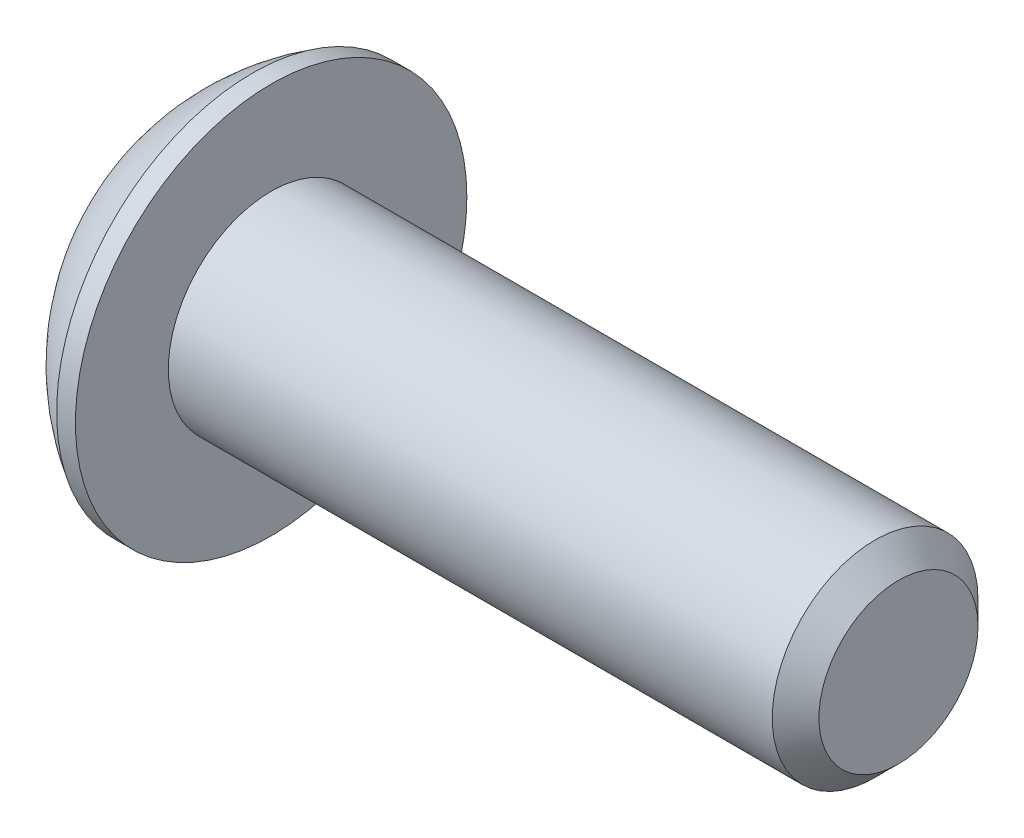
ISO-10303-21;
HEADER;
FILE_DESCRIPTION(('STEP AP214'),'2;1');
FILE_NAME('part.step','',(''),(''),'','','');
FILE_SCHEMA(('AUTOMOTIVE_DESIGN { 1 0 10303 214 1 1 1 1 }'));
ENDSEC;
DATA;
#1=APPLICATION_CONTEXT('core data for automotive mechanical design processes');
#2=APPLICATION_PROTOCOL_DEFINITION('international standard','automotive_design',2000,#1);
#3=PRODUCT_CONTEXT('',#1,'mechanical');
#4=PRODUCT('Part','Part','',(#3));
#5=PRODUCT_RELATED_PRODUCT_CATEGORY('part','',(#4));
#6=PRODUCT_DEFINITION_FORMATION('','',#4);
#7=PRODUCT_DEFINITION_CONTEXT('part definition',#1,'design');
#8=PRODUCT_DEFINITION('design','',#6,#7);
#9=PRODUCT_DEFINITION_SHAPE('','',#8);
#10=(LENGTH_UNIT() NAMED_UNIT(*) SI_UNIT(.MILLI.,.METRE.));
#11=(NAMED_UNIT(*) PLANE_ANGLE_UNIT() SI_UNIT($,.RADIAN.));
#12=(NAMED_UNIT(*) SI_UNIT($,.STERADIAN.) SOLID_ANGLE_UNIT());
#13=UNCERTAINTY_MEASURE_WITH_UNIT(LENGTH_MEASURE(1.E-05),#10,'distance_accuracy_value','');
#14=(GEOMETRIC_REPRESENTATION_CONTEXT(3) GLOBAL_UNCERTAINTY_ASSIGNED_CONTEXT((#13)) GLOBAL_UNIT_ASSIGNED_CONTEXT((#10,
#11,#12)) REPRESENTATION_CONTEXT('',''));
#15=CARTESIAN_POINT('',(0.,0.,0.));
#16=DIRECTION('',(0.,0.,1.));
#17=DIRECTION('',(1.,0.,0.));
#18=AXIS2_PLACEMENT_3D('',#15,#16,#17);
#19=CARTESIAN_POINT('',(7.4549,0.,0.));
#20=DIRECTION('',(1.,0.,0.));
#21=DIRECTION('',(0.,0.,-1.));
#22=AXIS2_PLACEMENT_3D('',#19,#20,#21);
#23=PLANE('',#22);
#24=CARTESIAN_POINT('',(7.4549,0.,0.));
#25=DIRECTION('',(1.,0.,0.));
#26=DIRECTION('',(0.,0.,-1.));
#27=AXIS2_PLACEMENT_3D('',#24,#25,#26);
#28=CIRCLE('',#27,1.6104);
#29=CARTESIAN_POINT('',(7.4549,0.,-1.6104));
#30=VERTEX_POINT('',#29);
#31=EDGE_CURVE('E40',#30,#30,#28,.T.);
#32=ORIENTED_EDGE('',*,*,#31,.T.);
#33=EDGE_LOOP('',(#32));
#34=FACE_BOUND('',#33,.T.);
#35=ADVANCED_FACE('F32',(#34),#23,.T.);
#36=CARTESIAN_POINT('',(7.4549,0.,0.));
#37=DIRECTION('',(1.,0.,0.));
#38=DIRECTION('',(0.,0.,-1.));
#39=AXIS2_PLACEMENT_3D('',#36,#37,#38);
#40=CYLINDRICAL_SURFACE('',#39,2.0828);
#41=CARTESIAN_POINT('',(6.9825,0.,0.));
#42=DIRECTION('',(1.,0.,0.));
#43=DIRECTION('',(0.,0.,-1.));
#44=AXIS2_PLACEMENT_3D('',#41,#42,#43);
#45=CIRCLE('',#44,2.0828);
#46=CARTESIAN_POINT('',(6.9825,0.,-2.0828));
#47=VERTEX_POINT('',#46);
#48=EDGE_CURVE('E11',#47,#47,#45,.F.);
#49=ORIENTED_EDGE('',*,*,#48,.T.);
#50=EDGE_LOOP('',(#49));
#51=FACE_BOUND('',#50,.T.);
#52=CARTESIAN_POINT('',(-5.2451,0.,0.));
#53=DIRECTION('',(1.,0.,0.));
#54=DIRECTION('',(0.,0.,-1.));
#55=AXIS2_PLACEMENT_3D('',#52,#53,#54);
#56=CIRCLE('',#55,2.0828);
#57=CARTESIAN_POINT('',(-5.2451,0.,-2.0828));
#58=VERTEX_POINT('',#57);
#59=EDGE_CURVE('E178',#58,#58,#56,.T.);
#60=ORIENTED_EDGE('',*,*,#59,.T.);
#61=EDGE_LOOP('',(#60));
#62=FACE_BOUND('',#61,.T.);
#63=ADVANCED_FACE('F305',(#51,#62),#40,.T.);
#64=CARTESIAN_POINT('',(-5.2451,2.0828,0.));
#65=DIRECTION('',(1.,0.,0.));
#66=DIRECTION('',(0.,0.,-1.));
#67=AXIS2_PLACEMENT_3D('',#64,#65,#66);
#68=PLANE('',#67);
#69=CARTESIAN_POINT('',(-5.2451,0.,0.));
#70=DIRECTION('',(1.,0.,0.));
#71=DIRECTION('',(0.,0.,-1.));
#72=AXIS2_PLACEMENT_3D('',#69,#70,#71);
#73=CIRCLE('',#72,3.9624);
#74=CARTESIAN_POINT('',(-5.2451,0.,-3.9624));
#75=VERTEX_POINT('',#74);
#76=EDGE_CURVE('E325',#75,#75,#73,.T.);
#77=ORIENTED_EDGE('',*,*,#76,.T.);
#78=EDGE_LOOP('',(#77));
#79=FACE_BOUND('',#78,.T.);
#80=ORIENTED_EDGE('',*,*,#59,.F.);
#81=EDGE_LOOP('',(#80));
#82=FACE_BOUND('',#81,.T.);
#83=ADVANCED_FACE('F301',(#79,#82),#68,.T.);
#84=CARTESIAN_POINT('',(7.4549,0.,0.));
#85=DIRECTION('',(1.,0.,0.));
#86=DIRECTION('',(0.,0.,-1.));
#87=AXIS2_PLACEMENT_3D('',#84,#85,#86);
#88=CYLINDRICAL_SURFACE('',#87,3.9624);
#89=CARTESIAN_POINT('',(-5.62610000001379,0.,0.));
#90=DIRECTION('',(1.,0.,0.));
#91=DIRECTION('',(0.,0.,-1.));
#92=AXIS2_PLACEMENT_3D('',#89,#90,#91);
#93=CIRCLE('',#92,3.9624);
#94=CARTESIAN_POINT('',(-5.62610000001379,0.,-3.9624));
#95=VERTEX_POINT('',#94);
#96=EDGE_CURVE('E327',#95,#95,#93,.T.);
#97=ORIENTED_EDGE('',*,*,#96,.T.);
#98=EDGE_LOOP('',(#97));
#99=FACE_BOUND('',#98,.T.);
#100=ORIENTED_EDGE('',*,*,#76,.F.);
#101=EDGE_LOOP('',(#100));
#102=FACE_BOUND('',#101,.T.);
#103=ADVANCED_FACE('F297',(#99,#102),#88,.T.);
#104=CARTESIAN_POINT('',(-3.3210413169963,0.,0.));
#105=DIRECTION('',(1.,0.,0.));
#106=DIRECTION('',(0.,0.,-1.));
#107=AXIS2_PLACEMENT_3D('',#104,#105,#106);
#108=DEGENERATE_TOROIDAL_SURFACE('',#107,8.01506428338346E-06,4.5841,.F.);
#109=CARTESIAN_POINT('',(-7.4549,0.,0.));
#110=DIRECTION('',(1.,0.,0.));
#111=DIRECTION('',(0.,0.,-1.));
#112=AXIS2_PLACEMENT_3D('',#109,#110,#111);
#113=CIRCLE('',#112,1.9812);
#114=CARTESIAN_POINT('',(-7.4549,0.,-1.9812));
#115=VERTEX_POINT('',#114);
#116=EDGE_CURVE('E330',#115,#115,#113,.T.);
#117=ORIENTED_EDGE('',*,*,#116,.T.);
#118=EDGE_LOOP('',(#117));
#119=FACE_BOUND('',#118,.T.);
#120=ORIENTED_EDGE('',*,*,#96,.F.);
#121=EDGE_LOOP('',(#120));
#122=FACE_BOUND('',#121,.T.);
#123=ADVANCED_FACE('F293',(#119,#122),#108,.F.);
#124=CARTESIAN_POINT('',(-7.4549,1.9812,0.));
#125=DIRECTION('',(-1.,0.,0.));
#126=DIRECTION('',(0.,0.,1.));
#127=AXIS2_PLACEMENT_3D('',#124,#125,#126);
#128=PLANE('',#127);
#129=CARTESIAN_POINT('',(-7.4549,0.,0.));
#130=DIRECTION('',(-1.,0.,0.));
#131=DIRECTION('',(0.,0.,1.));
#132=AXIS2_PLACEMENT_3D('',#129,#130,#131);
#133=CIRCLE('',#132,1.194);
#134=CARTESIAN_POINT('',(-7.4549,1.02293455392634,0.6158253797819));
#135=VERTEX_POINT('',#134);
#136=CARTESIAN_POINT('',(-7.4549,1.04478770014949,0.577974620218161));
#137=VERTEX_POINT('',#136);
#138=EDGE_CURVE('E169',#135,#137,#133,.T.);
#139=ORIENTED_EDGE('',*,*,#138,.F.);
#140=DIRECTION('',(0.,0.5,-0.866025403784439));
#141=VECTOR('',#140,1.);
#142=CARTESIAN_POINT('',(-7.4549,1.37848150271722,0.));
#143=LINE('',#142,#141);
#144=CARTESIAN_POINT('',(-7.4549,0.689240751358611,1.19380000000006));
#145=VERTEX_POINT('',#144);
#146=EDGE_CURVE('E354',#145,#135,#143,.T.);
#147=ORIENTED_EDGE('',*,*,#146,.F.);
#148=DIRECTION('',(0.,1.,0.));
#149=VECTOR('',#148,1.);
#150=CARTESIAN_POINT('',(-7.4549,0.689240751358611,1.19380000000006));
#151=LINE('',#150,#149);
#152=CARTESIAN_POINT('',(-7.4549,0.0218531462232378,1.19380000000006));
#153=VERTEX_POINT('',#152);
#154=EDGE_CURVE('E362',#153,#145,#151,.T.);
#155=ORIENTED_EDGE('',*,*,#154,.F.);
#156=CARTESIAN_POINT('',(-7.4549,-0.02185314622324,1.19380000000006));
#157=VERTEX_POINT('',#156);
#158=EDGE_CURVE('E175',#157,#153,#133,.T.);
#159=ORIENTED_EDGE('',*,*,#158,.F.);
#160=CARTESIAN_POINT('',(-7.4549,-0.68924075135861,1.19380000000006));
#161=VERTEX_POINT('',#160);
#162=EDGE_CURVE('E359',#161,#157,#151,.T.);
#163=ORIENTED_EDGE('',*,*,#162,.F.);
#164=DIRECTION('',(0.,0.5,0.866025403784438));
#165=VECTOR('',#164,1.);
#166=CARTESIAN_POINT('',(-7.4549,-0.68924075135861,1.19380000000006));
#167=LINE('',#166,#165);
#168=CARTESIAN_POINT('',(-7.4549,-1.02293455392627,0.615825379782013));
#169=VERTEX_POINT('',#168);
#170=EDGE_CURVE('E366',#169,#161,#167,.T.);
#171=ORIENTED_EDGE('',*,*,#170,.F.);
#172=CARTESIAN_POINT('',(-7.4549,-1.04478770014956,0.577974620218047));
#173=VERTEX_POINT('',#172);
#174=EDGE_CURVE('E412',#173,#169,#133,.T.);
#175=ORIENTED_EDGE('',*,*,#174,.F.);
#176=CARTESIAN_POINT('',(-7.4549,-1.37848150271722,0.));
#177=VERTEX_POINT('',#176);
#178=EDGE_CURVE('E363',#177,#173,#167,.T.);
#179=ORIENTED_EDGE('',*,*,#178,.F.);
#180=DIRECTION('',(0.,-0.5,0.866025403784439));
#181=VECTOR('',#180,1.);
#182=CARTESIAN_POINT('',(-7.4549,-1.37848150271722,0.));
#183=LINE('',#182,#181);
#184=CARTESIAN_POINT('',(-7.4549,-1.04478770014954,-0.577974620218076));
#185=VERTEX_POINT('',#184);
#186=EDGE_CURVE('E370',#185,#177,#183,.T.);
#187=ORIENTED_EDGE('',*,*,#186,.F.);
#188=CARTESIAN_POINT('',(-7.4549,-1.02293455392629,-0.615825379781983));
#189=VERTEX_POINT('',#188);
#190=EDGE_CURVE('E411',#189,#185,#133,.T.);
#191=ORIENTED_EDGE('',*,*,#190,.F.);
#192=CARTESIAN_POINT('',(-7.4549,-0.689240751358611,-1.19380000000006));
#193=VERTEX_POINT('',#192);
#194=EDGE_CURVE('E367',#193,#189,#183,.T.);
#195=ORIENTED_EDGE('',*,*,#194,.F.);
#196=DIRECTION('',(0.,-1.,0.));
#197=VECTOR('',#196,1.);
#198=CARTESIAN_POINT('',(-7.4549,-0.689240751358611,-1.19380000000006));
#199=LINE('',#198,#197);
#200=CARTESIAN_POINT('',(-7.4549,-0.02185314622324,-1.19380000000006));
#201=VERTEX_POINT('',#200);
#202=EDGE_CURVE('E374',#201,#193,#199,.T.);
#203=ORIENTED_EDGE('',*,*,#202,.F.);
#204=CARTESIAN_POINT('',(-7.4549,0.0218531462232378,-1.19380000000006));
#205=VERTEX_POINT('',#204);
#206=EDGE_CURVE('E410',#205,#201,#133,.T.);
#207=ORIENTED_EDGE('',*,*,#206,.F.);
#208=CARTESIAN_POINT('',(-7.4549,0.689240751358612,-1.19380000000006));
#209=VERTEX_POINT('',#208);
#210=EDGE_CURVE('E371',#209,#205,#199,.T.);
#211=ORIENTED_EDGE('',*,*,#210,.F.);
#212=DIRECTION('',(0.,-0.499999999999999,-0.866025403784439));
#213=VECTOR('',#212,1.);
#214=CARTESIAN_POINT('',(-7.4549,0.689240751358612,-1.19380000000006));
#215=LINE('',#214,#213);
#216=CARTESIAN_POINT('',(-7.4549,1.02293455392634,-0.615825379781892));
#217=VERTEX_POINT('',#216);
#218=EDGE_CURVE('E378',#217,#209,#215,.T.);
#219=ORIENTED_EDGE('',*,*,#218,.F.);
#220=CARTESIAN_POINT('',(-7.4549,1.04478770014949,-0.577974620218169));
#221=VERTEX_POINT('',#220);
#222=EDGE_CURVE('E173',#221,#217,#133,.T.);
#223=ORIENTED_EDGE('',*,*,#222,.F.);
#224=CARTESIAN_POINT('',(-7.4549,1.37848150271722,0.));
#225=VERTEX_POINT('',#224);
#226=EDGE_CURVE('E375',#225,#221,#215,.T.);
#227=ORIENTED_EDGE('',*,*,#226,.F.);
#228=EDGE_CURVE('E358',#137,#225,#143,.T.);
#229=ORIENTED_EDGE('',*,*,#228,.F.);
#230=EDGE_LOOP('',(#139,#147,#155,#159,#163,#171,#175,#179,#187,#191,#195,#203,#207,#211,#219,
#223,#227,#229));
#231=FACE_BOUND('',#230,.T.);
#232=ORIENTED_EDGE('',*,*,#116,.F.);
#233=EDGE_LOOP('',(#232));
#234=FACE_BOUND('',#233,.T.);
#235=ADVANCED_FACE('F287',(#231,#234),#128,.T.);
#236=CARTESIAN_POINT('',(-6.1341,0.689240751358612,-1.19380000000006));
#237=DIRECTION('',(0.,0.866025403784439,-0.5));
#238=DIRECTION('',(0.,0.5,0.866025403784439));
#239=AXIS2_PLACEMENT_3D('',#236,#237,#238);
#240=PLANE('',#239);
#241=CARTESIAN_POINT('',(-6.1349,1.04478770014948,-0.577974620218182));
#242=DIRECTION('',(0.,-0.499999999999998,-0.86602540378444));
#243=VECTOR('',#242,1.);
#244=LINE('',#241,#243);
#245=CARTESIAN_POINT('',(-6.1349,1.04478770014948,-0.577974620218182));
#246=VERTEX_POINT('',#245);
#247=CARTESIAN_POINT('',(-6.1349,1.02293455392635,-0.615825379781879));
#248=VERTEX_POINT('',#247);
#249=EDGE_CURVE('E205',#246,#248,#244,.T.);
#250=ORIENTED_EDGE('',*,*,#249,.T.);
#251=DIRECTION('',(-1.,0.,0.));
#252=VECTOR('',#251,1.);
#253=CARTESIAN_POINT('',(-7.4549,1.02293455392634,-0.615825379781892));
#254=LINE('',#253,#252);
#255=EDGE_CURVE('E47',#248,#217,#254,.T.);
#256=ORIENTED_EDGE('',*,*,#255,.T.);
#257=ORIENTED_EDGE('',*,*,#218,.T.);
#258=DIRECTION('',(-1.,0.,0.));
#259=VECTOR('',#258,1.);
#260=CARTESIAN_POINT('',(-6.1341,0.689240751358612,-1.19380000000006));
#261=LINE('',#260,#259);
#262=CARTESIAN_POINT('',(-6.1341,0.689240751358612,-1.19380000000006));
#263=VERTEX_POINT('',#262);
#264=EDGE_CURVE('E336',#263,#209,#261,.T.);
#265=ORIENTED_EDGE('',*,*,#264,.F.);
#266=DIRECTION('',(0.,-0.499999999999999,-0.866025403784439));
#267=VECTOR('',#266,1.);
#268=CARTESIAN_POINT('',(-6.1341,0.689240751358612,-1.19380000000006));
#269=LINE('',#268,#267);
#270=CARTESIAN_POINT('',(-6.1341,1.37848150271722,0.));
#271=VERTEX_POINT('',#270);
#272=EDGE_CURVE('E357',#271,#263,#269,.T.);
#273=ORIENTED_EDGE('',*,*,#272,.F.);
#274=DIRECTION('',(-1.,0.,0.));
#275=VECTOR('',#274,1.);
#276=CARTESIAN_POINT('',(-6.1341,1.37848150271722,0.));
#277=LINE('',#276,#275);
#278=EDGE_CURVE('E335',#271,#225,#277,.T.);
#279=ORIENTED_EDGE('',*,*,#278,.T.);
#280=ORIENTED_EDGE('',*,*,#226,.T.);
#281=DIRECTION('',(-1.,0.,0.));
#282=VECTOR('',#281,1.);
#283=CARTESIAN_POINT('',(-7.4549,1.04478770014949,-0.577974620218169));
#284=LINE('',#283,#282);
#285=EDGE_CURVE('E254',#221,#246,#284,.F.);
#286=ORIENTED_EDGE('',*,*,#285,.T.);
#287=EDGE_LOOP('',(#250,#256,#257,#265,#273,#279,#280,#286));
#288=FACE_BOUND('',#287,.T.);
#289=ADVANCED_FACE('F277',(#288),#240,.F.);
#290=CARTESIAN_POINT('',(-6.1341,1.37848150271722,0.));
#291=DIRECTION('',(0.,0.866025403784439,0.5));
#292=DIRECTION('',(0.,-0.5,0.866025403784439));
#293=AXIS2_PLACEMENT_3D('',#290,#291,#292);
#294=PLANE('',#293);
#295=CARTESIAN_POINT('',(-6.1349,1.02293455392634,0.6158253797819));
#296=DIRECTION('',(0.,0.500000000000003,-0.866025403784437));
#297=VECTOR('',#296,1.);
#298=LINE('',#295,#297);
#299=CARTESIAN_POINT('',(-6.1349,1.02293455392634,0.6158253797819));
#300=VERTEX_POINT('',#299);
#301=CARTESIAN_POINT('',(-6.1349,1.04478770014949,0.577974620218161));
#302=VERTEX_POINT('',#301);
#303=EDGE_CURVE('E402',#300,#302,#298,.T.);
#304=ORIENTED_EDGE('',*,*,#303,.T.);
#305=DIRECTION('',(-1.,0.,0.));
#306=VECTOR('',#305,1.);
#307=CARTESIAN_POINT('',(-7.4549,1.04478770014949,0.577974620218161));
#308=LINE('',#307,#306);
#309=EDGE_CURVE('E55',#302,#137,#308,.T.);
#310=ORIENTED_EDGE('',*,*,#309,.T.);
#311=ORIENTED_EDGE('',*,*,#228,.T.);
#312=ORIENTED_EDGE('',*,*,#278,.F.);
#313=DIRECTION('',(0.,0.5,-0.866025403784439));
#314=VECTOR('',#313,1.);
#315=CARTESIAN_POINT('',(-6.1341,1.37848150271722,0.));
#316=LINE('',#315,#314);
#317=CARTESIAN_POINT('',(-6.1341,0.689240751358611,1.19380000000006));
#318=VERTEX_POINT('',#317);
#319=EDGE_CURVE('E340',#318,#271,#316,.T.);
#320=ORIENTED_EDGE('',*,*,#319,.F.);
#321=DIRECTION('',(-1.,0.,0.));
#322=VECTOR('',#321,1.);
#323=CARTESIAN_POINT('',(-6.1341,0.689240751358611,1.19380000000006));
#324=LINE('',#323,#322);
#325=EDGE_CURVE('E349',#318,#145,#324,.T.);
#326=ORIENTED_EDGE('',*,*,#325,.T.);
#327=ORIENTED_EDGE('',*,*,#146,.T.);
#328=DIRECTION('',(-1.,0.,0.));
#329=VECTOR('',#328,1.);
#330=CARTESIAN_POINT('',(-7.4549,1.02293455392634,0.6158253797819));
#331=LINE('',#330,#329);
#332=EDGE_CURVE('E452',#135,#300,#331,.F.);
#333=ORIENTED_EDGE('',*,*,#332,.T.);
#334=EDGE_LOOP('',(#304,#310,#311,#312,#320,#326,#327,#333));
#335=FACE_BOUND('',#334,.T.);
#336=ADVANCED_FACE('F286',(#335),#294,.F.);
#337=CARTESIAN_POINT('',(-6.1341,0.689240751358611,1.19380000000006));
#338=DIRECTION('',(0.,0.,1.));
#339=DIRECTION('',(1.,0.,0.));
#340=AXIS2_PLACEMENT_3D('',#337,#338,#339);
#341=PLANE('',#340);
#342=CARTESIAN_POINT('',(-6.1349,-0.0218531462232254,1.19380000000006));
#343=DIRECTION('',(0.,1.,0.));
#344=VECTOR('',#343,1.);
#345=LINE('',#342,#344);
#346=CARTESIAN_POINT('',(-6.1349,-0.0218531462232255,1.19380000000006));
#347=VERTEX_POINT('',#346);
#348=CARTESIAN_POINT('',(-6.13489999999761,0.0218531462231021,1.19380000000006));
#349=VERTEX_POINT('',#348);
#350=EDGE_CURVE('E491',#347,#349,#345,.T.);
#351=ORIENTED_EDGE('',*,*,#350,.T.);
#352=DIRECTION('',(-1.,0.,0.));
#353=VECTOR('',#352,1.);
#354=CARTESIAN_POINT('',(-7.4549,0.0218531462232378,1.19380000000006));
#355=LINE('',#354,#353);
#356=EDGE_CURVE('E453',#349,#153,#355,.T.);
#357=ORIENTED_EDGE('',*,*,#356,.T.);
#358=ORIENTED_EDGE('',*,*,#154,.T.);
#359=ORIENTED_EDGE('',*,*,#325,.F.);
#360=DIRECTION('',(0.,1.,0.));
#361=VECTOR('',#360,1.);
#362=CARTESIAN_POINT('',(-6.1341,0.689240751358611,1.19380000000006));
#363=LINE('',#362,#361);
#364=CARTESIAN_POINT('',(-6.1341,-0.68924075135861,1.19380000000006));
#365=VERTEX_POINT('',#364);
#366=EDGE_CURVE('E381',#365,#318,#363,.T.);
#367=ORIENTED_EDGE('',*,*,#366,.F.);
#368=DIRECTION('',(-1.,0.,0.));
#369=VECTOR('',#368,1.);
#370=CARTESIAN_POINT('',(-6.1341,-0.68924075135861,1.19380000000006));
#371=LINE('',#370,#369);
#372=EDGE_CURVE('E346',#365,#161,#371,.T.);
#373=ORIENTED_EDGE('',*,*,#372,.T.);
#374=ORIENTED_EDGE('',*,*,#162,.T.);
#375=DIRECTION('',(-1.,0.,0.));
#376=VECTOR('',#375,1.);
#377=CARTESIAN_POINT('',(-7.4549,-0.02185314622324,1.19380000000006));
#378=LINE('',#377,#376);
#379=EDGE_CURVE('E437',#157,#347,#378,.F.);
#380=ORIENTED_EDGE('',*,*,#379,.T.);
#381=EDGE_LOOP('',(#351,#357,#358,#359,#367,#373,#374,#380));
#382=FACE_BOUND('',#381,.T.);
#383=ADVANCED_FACE('F444',(#382),#341,.F.);
#384=CARTESIAN_POINT('',(-6.1341,-0.68924075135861,1.19380000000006));
#385=DIRECTION('',(0.,-0.866025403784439,0.5));
#386=DIRECTION('',(0.,-0.5,-0.866025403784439));
#387=AXIS2_PLACEMENT_3D('',#384,#385,#386);
#388=PLANE('',#387);
#389=CARTESIAN_POINT('',(-6.1349,-1.04478770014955,0.57797462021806));
#390=DIRECTION('',(0.,0.499999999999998,0.86602540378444));
#391=VECTOR('',#390,1.);
#392=LINE('',#389,#391);
#393=CARTESIAN_POINT('',(-6.1349,-1.04478770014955,0.57797462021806));
#394=VERTEX_POINT('',#393);
#395=CARTESIAN_POINT('',(-6.1349,-1.02293455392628,0.615825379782));
#396=VERTEX_POINT('',#395);
#397=EDGE_CURVE('E435',#394,#396,#392,.T.);
#398=ORIENTED_EDGE('',*,*,#397,.T.);
#399=DIRECTION('',(-1.,0.,0.));
#400=VECTOR('',#399,1.);
#401=CARTESIAN_POINT('',(-7.4549,-1.02293455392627,0.615825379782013));
#402=LINE('',#401,#400);
#403=EDGE_CURVE('E429',#396,#169,#402,.T.);
#404=ORIENTED_EDGE('',*,*,#403,.T.);
#405=ORIENTED_EDGE('',*,*,#170,.T.);
#406=ORIENTED_EDGE('',*,*,#372,.F.);
#407=DIRECTION('',(0.,0.5,0.866025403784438));
#408=VECTOR('',#407,1.);
#409=CARTESIAN_POINT('',(-6.1341,-0.68924075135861,1.19380000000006));
#410=LINE('',#409,#408);
#411=CARTESIAN_POINT('',(-6.1341,-1.37848150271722,0.));
#412=VERTEX_POINT('',#411);
#413=EDGE_CURVE('E384',#412,#365,#410,.T.);
#414=ORIENTED_EDGE('',*,*,#413,.F.);
#415=DIRECTION('',(-1.,0.,0.));
#416=VECTOR('',#415,1.);
#417=CARTESIAN_POINT('',(-6.1341,-1.37848150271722,0.));
#418=LINE('',#417,#416);
#419=EDGE_CURVE('E343',#412,#177,#418,.T.);
#420=ORIENTED_EDGE('',*,*,#419,.T.);
#421=ORIENTED_EDGE('',*,*,#178,.T.);
#422=DIRECTION('',(-1.,0.,0.));
#423=VECTOR('',#422,1.);
#424=CARTESIAN_POINT('',(-7.4549,-1.04478770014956,0.577974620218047));
#425=LINE('',#424,#423);
#426=EDGE_CURVE('E212',#173,#394,#425,.F.);
#427=ORIENTED_EDGE('',*,*,#426,.T.);
#428=EDGE_LOOP('',(#398,#404,#405,#406,#414,#420,#421,#427));
#429=FACE_BOUND('',#428,.T.);
#430=ADVANCED_FACE('F434',(#429),#388,.F.);
#431=CARTESIAN_POINT('',(-6.1341,-1.37848150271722,0.));
#432=DIRECTION('',(0.,-0.866025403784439,-0.5));
#433=DIRECTION('',(0.,0.5,-0.866025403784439));
#434=AXIS2_PLACEMENT_3D('',#431,#432,#433);
#435=PLANE('',#434);
#436=CARTESIAN_POINT('',(-6.1349,-1.02293455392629,-0.615825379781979));
#437=DIRECTION('',(0.,-0.499999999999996,0.866025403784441));
#438=VECTOR('',#437,1.);
#439=LINE('',#436,#438);
#440=CARTESIAN_POINT('',(-6.1349,-1.02293455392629,-0.615825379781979));
#441=VERTEX_POINT('',#440);
#442=CARTESIAN_POINT('',(-6.1349,-1.04478770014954,-0.577974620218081));
#443=VERTEX_POINT('',#442);
#444=EDGE_CURVE('E172',#441,#443,#439,.T.);
#445=ORIENTED_EDGE('',*,*,#444,.T.);
#446=DIRECTION('',(-1.,0.,0.));
#447=VECTOR('',#446,1.);
#448=CARTESIAN_POINT('',(-7.4549,-1.04478770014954,-0.577974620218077));
#449=LINE('',#448,#447);
#450=EDGE_CURVE('E204',#443,#185,#449,.T.);
#451=ORIENTED_EDGE('',*,*,#450,.T.);
#452=ORIENTED_EDGE('',*,*,#186,.T.);
#453=ORIENTED_EDGE('',*,*,#419,.F.);
#454=DIRECTION('',(0.,-0.5,0.866025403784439));
#455=VECTOR('',#454,1.);
#456=CARTESIAN_POINT('',(-6.1341,-1.37848150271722,0.));
#457=LINE('',#456,#455);
#458=CARTESIAN_POINT('',(-6.1341,-0.689240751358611,-1.19380000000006));
#459=VERTEX_POINT('',#458);
#460=EDGE_CURVE('E387',#459,#412,#457,.T.);
#461=ORIENTED_EDGE('',*,*,#460,.F.);
#462=DIRECTION('',(-1.,0.,0.));
#463=VECTOR('',#462,1.);
#464=CARTESIAN_POINT('',(-6.1341,-0.689240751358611,-1.19380000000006));
#465=LINE('',#464,#463);
#466=EDGE_CURVE('E339',#459,#193,#465,.T.);
#467=ORIENTED_EDGE('',*,*,#466,.T.);
#468=ORIENTED_EDGE('',*,*,#194,.T.);
#469=DIRECTION('',(-1.,0.,0.));
#470=VECTOR('',#469,1.);
#471=CARTESIAN_POINT('',(-7.4549,-1.02293455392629,-0.615825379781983));
#472=LINE('',#471,#470);
#473=EDGE_CURVE('E200',#189,#441,#472,.F.);
#474=ORIENTED_EDGE('',*,*,#473,.T.);
#475=EDGE_LOOP('',(#445,#451,#452,#453,#461,#467,#468,#474));
#476=FACE_BOUND('',#475,.T.);
#477=ADVANCED_FACE('F421',(#476),#435,.F.);
#478=CARTESIAN_POINT('',(-6.1341,-0.689240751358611,-1.19380000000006));
#479=DIRECTION('',(0.,0.,-1.));
#480=DIRECTION('',(-1.,0.,0.));
#481=AXIS2_PLACEMENT_3D('',#478,#479,#480);
#482=PLANE('',#481);
#483=CARTESIAN_POINT('',(-6.1349,0.0218531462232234,-1.19380000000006));
#484=DIRECTION('',(0.,-1.,0.));
#485=VECTOR('',#484,1.);
#486=LINE('',#483,#485);
#487=CARTESIAN_POINT('',(-6.1349,0.0218531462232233,-1.19380000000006));
#488=VERTEX_POINT('',#487);
#489=CARTESIAN_POINT('',(-6.1348999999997,-0.0218531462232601,-1.19380000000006));
#490=VERTEX_POINT('',#489);
#491=EDGE_CURVE('E168',#488,#490,#486,.T.);
#492=ORIENTED_EDGE('',*,*,#491,.T.);
#493=DIRECTION('',(-1.,0.,0.));
#494=VECTOR('',#493,1.);
#495=CARTESIAN_POINT('',(-7.4549,-0.02185314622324,-1.19380000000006));
#496=LINE('',#495,#494);
#497=EDGE_CURVE('E189',#490,#201,#496,.T.);
#498=ORIENTED_EDGE('',*,*,#497,.T.);
#499=ORIENTED_EDGE('',*,*,#202,.T.);
#500=ORIENTED_EDGE('',*,*,#466,.F.);
#501=DIRECTION('',(0.,-1.,0.));
#502=VECTOR('',#501,1.);
#503=CARTESIAN_POINT('',(-6.1341,-0.689240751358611,-1.19380000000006));
#504=LINE('',#503,#502);
#505=EDGE_CURVE('E390',#263,#459,#504,.T.);
#506=ORIENTED_EDGE('',*,*,#505,.F.);
#507=ORIENTED_EDGE('',*,*,#264,.T.);
#508=ORIENTED_EDGE('',*,*,#210,.T.);
#509=DIRECTION('',(-1.,0.,0.));
#510=VECTOR('',#509,1.);
#511=CARTESIAN_POINT('',(-7.4549,0.0218531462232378,-1.19380000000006));
#512=LINE('',#511,#510);
#513=EDGE_CURVE('E185',#205,#488,#512,.F.);
#514=ORIENTED_EDGE('',*,*,#513,.T.);
#515=EDGE_LOOP('',(#492,#498,#499,#500,#506,#507,#508,#514));
#516=FACE_BOUND('',#515,.T.);
#517=ADVANCED_FACE('F288',(#516),#482,.F.);
#518=CARTESIAN_POINT('',(-6.1341,2.06772225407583,1.19380000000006));
#519=DIRECTION('',(1.,0.,0.));
#520=DIRECTION('',(0.,0.,-1.));
#521=AXIS2_PLACEMENT_3D('',#518,#519,#520);
#522=PLANE('',#521);
#523=CARTESIAN_POINT('',(-6.1341,0.,0.));
#524=DIRECTION('',(1.,0.,0.));
#525=DIRECTION('',(0.,0.,-1.));
#526=AXIS2_PLACEMENT_3D('',#523,#524,#525);
#527=CIRCLE('',#526,1.19261435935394);
#528=CARTESIAN_POINT('',(-6.1341,0.,-1.19261435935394));
#529=VERTEX_POINT('',#528);
#530=EDGE_CURVE('E166',#529,#529,#527,.T.);
#531=ORIENTED_EDGE('',*,*,#530,.T.);
#532=EDGE_LOOP('',(#531));
#533=FACE_BOUND('',#532,.T.);
#534=ORIENTED_EDGE('',*,*,#272,.T.);
#535=ORIENTED_EDGE('',*,*,#505,.T.);
#536=ORIENTED_EDGE('',*,*,#460,.T.);
#537=ORIENTED_EDGE('',*,*,#413,.T.);
#538=ORIENTED_EDGE('',*,*,#366,.T.);
#539=ORIENTED_EDGE('',*,*,#319,.T.);
#540=EDGE_LOOP('',(#534,#535,#536,#537,#538,#539));
#541=FACE_BOUND('',#540,.T.);
#542=ADVANCED_FACE('F162',(#533,#541),#522,.F.);
#543=CARTESIAN_POINT('',(-6.1349,0.,0.));
#544=DIRECTION('',(-1.,0.,0.));
#545=DIRECTION('',(0.,0.,1.));
#546=AXIS2_PLACEMENT_3D('',#543,#544,#545);
#547=CONICAL_SURFACE('',#546,1.194,1.0471975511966);
#548=CARTESIAN_POINT('',(-5.44554377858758,0.,0.));
#549=VERTEX_POINT('',#548);
#550=VERTEX_LOOP('',#549);
#551=FACE_BOUND('',#550,.T.);
#552=ORIENTED_EDGE('',*,*,#530,.F.);
#553=EDGE_LOOP('',(#552));
#554=FACE_BOUND('',#553,.T.);
#555=ADVANCED_FACE('F158',(#551,#554),#547,.F.);
#556=CARTESIAN_POINT('',(-7.4549,0.,0.));
#557=DIRECTION('',(-1.,0.,0.));
#558=DIRECTION('',(0.,0.,1.));
#559=AXIS2_PLACEMENT_3D('',#556,#557,#558);
#560=CYLINDRICAL_SURFACE('',#559,1.194);
#561=ORIENTED_EDGE('',*,*,#491,.F.);
#562=ORIENTED_EDGE('',*,*,#513,.F.);
#563=ORIENTED_EDGE('',*,*,#206,.T.);
#564=ORIENTED_EDGE('',*,*,#497,.F.);
#565=EDGE_LOOP('',(#561,#562,#563,#564));
#566=FACE_BOUND('',#565,.T.);
#567=ADVANCED_FACE('F161',(#566),#560,.F.);
#568=ORIENTED_EDGE('',*,*,#444,.F.);
#569=ORIENTED_EDGE('',*,*,#473,.F.);
#570=ORIENTED_EDGE('',*,*,#190,.T.);
#571=ORIENTED_EDGE('',*,*,#450,.F.);
#572=EDGE_LOOP('',(#568,#569,#570,#571));
#573=FACE_BOUND('',#572,.T.);
#574=ADVANCED_FACE('F503',(#573),#560,.F.);
#575=ORIENTED_EDGE('',*,*,#397,.F.);
#576=ORIENTED_EDGE('',*,*,#426,.F.);
#577=ORIENTED_EDGE('',*,*,#174,.T.);
#578=ORIENTED_EDGE('',*,*,#403,.F.);
#579=EDGE_LOOP('',(#575,#576,#577,#578));
#580=FACE_BOUND('',#579,.T.);
#581=ADVANCED_FACE('F428',(#580),#560,.F.);
#582=ORIENTED_EDGE('',*,*,#350,.F.);
#583=ORIENTED_EDGE('',*,*,#379,.F.);
#584=ORIENTED_EDGE('',*,*,#158,.T.);
#585=ORIENTED_EDGE('',*,*,#356,.F.);
#586=EDGE_LOOP('',(#582,#583,#584,#585));
#587=FACE_BOUND('',#586,.T.);
#588=ADVANCED_FACE('F492',(#587),#560,.F.);
#589=ORIENTED_EDGE('',*,*,#303,.F.);
#590=ORIENTED_EDGE('',*,*,#332,.F.);
#591=ORIENTED_EDGE('',*,*,#138,.T.);
#592=ORIENTED_EDGE('',*,*,#309,.F.);
#593=EDGE_LOOP('',(#589,#590,#591,#592));
#594=FACE_BOUND('',#593,.T.);
#595=ADVANCED_FACE('F230',(#594),#560,.F.);
#596=ORIENTED_EDGE('',*,*,#249,.F.);
#597=ORIENTED_EDGE('',*,*,#285,.F.);
#598=ORIENTED_EDGE('',*,*,#222,.T.);
#599=ORIENTED_EDGE('',*,*,#255,.F.);
#600=EDGE_LOOP('',(#596,#597,#598,#599));
#601=FACE_BOUND('',#600,.T.);
#602=ADVANCED_FACE('F221',(#601),#560,.F.);
#603=CARTESIAN_POINT('',(7.4549,0.,0.));
#604=DIRECTION('',(-1.,0.,0.));
#605=DIRECTION('',(0.,0.,1.));
#606=AXIS2_PLACEMENT_3D('',#603,#604,#605);
#607=CONICAL_SURFACE('',#606,1.6104,0.785398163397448);
#608=ORIENTED_EDGE('',*,*,#48,.F.);
#609=EDGE_LOOP('',(#608));
#610=FACE_BOUND('',#609,.T.);
#611=ORIENTED_EDGE('',*,*,#31,.F.);
#612=EDGE_LOOP('',(#611));
#613=FACE_BOUND('',#612,.T.);
#614=ADVANCED_FACE('F34',(#610,#613),#607,.T.);
#615=CLOSED_SHELL('',(#35,#63,#83,#103,#123,#235,#289,#336,#383,#430,#477,#517,#542,#555,#567,
#574,#581,#588,#595,#602,#614));
#616=MANIFOLD_SOLID_BREP('B2',#615);
#617=ADVANCED_BREP_SHAPE_REPRESENTATION('',(#18,#616),#14);
#618=SHAPE_DEFINITION_REPRESENTATION(#9,#617);
ENDSEC;
END-ISO-10303-21;
